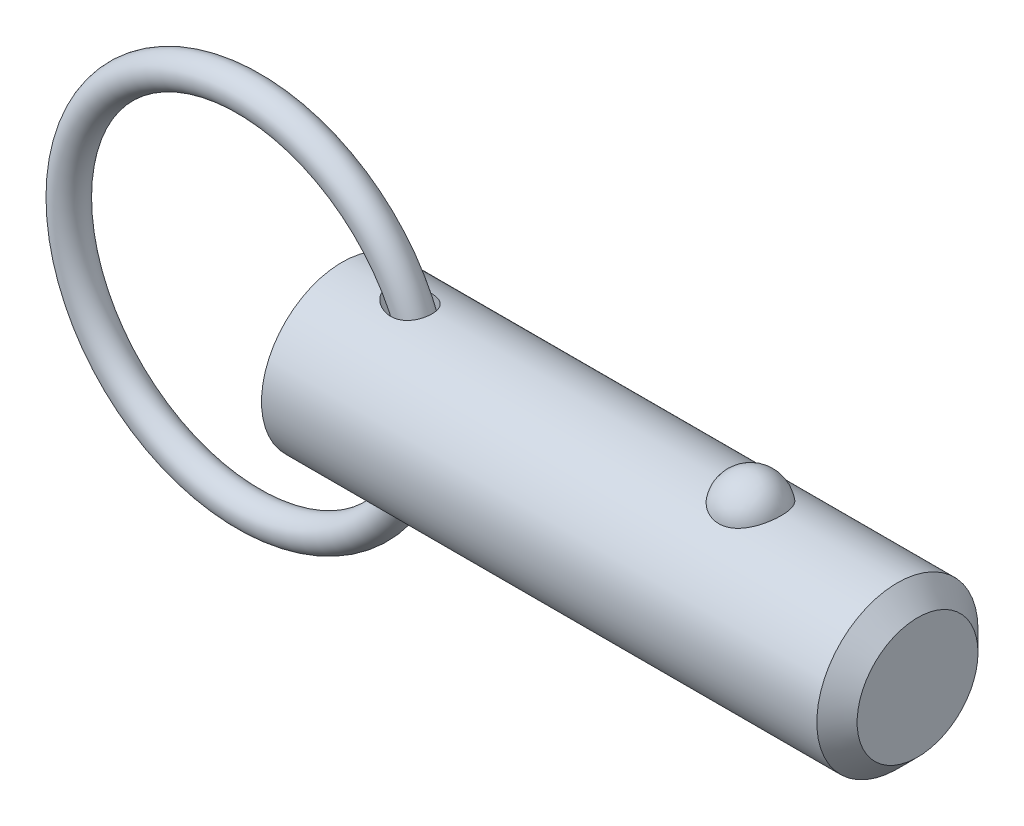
ISO-10303-21;
HEADER;
FILE_DESCRIPTION(('STEP AP214'),'2;1');
FILE_NAME('part.step','',(''),(''),'','','');
FILE_SCHEMA(('AUTOMOTIVE_DESIGN { 1 0 10303 214 1 1 1 1 }'));
ENDSEC;
DATA;
#1=APPLICATION_CONTEXT('core data for automotive mechanical design processes');
#2=APPLICATION_PROTOCOL_DEFINITION('international standard','automotive_design',2000,#1);
#3=PRODUCT_CONTEXT('',#1,'mechanical');
#4=PRODUCT('Part','Part','',(#3));
#5=PRODUCT_RELATED_PRODUCT_CATEGORY('part','',(#4));
#6=PRODUCT_DEFINITION_FORMATION('','',#4);
#7=PRODUCT_DEFINITION_CONTEXT('part definition',#1,'design');
#8=PRODUCT_DEFINITION('design','',#6,#7);
#9=PRODUCT_DEFINITION_SHAPE('','',#8);
#10=(LENGTH_UNIT() NAMED_UNIT(*) SI_UNIT(.MILLI.,.METRE.));
#11=(NAMED_UNIT(*) PLANE_ANGLE_UNIT() SI_UNIT($,.RADIAN.));
#12=(NAMED_UNIT(*) SI_UNIT($,.STERADIAN.) SOLID_ANGLE_UNIT());
#13=UNCERTAINTY_MEASURE_WITH_UNIT(LENGTH_MEASURE(1.E-05),#10,'distance_accuracy_value','');
#14=(GEOMETRIC_REPRESENTATION_CONTEXT(3) GLOBAL_UNCERTAINTY_ASSIGNED_CONTEXT((#13)) GLOBAL_UNIT_ASSIGNED_CONTEXT((#10,
#11,#12)) REPRESENTATION_CONTEXT('',''));
#15=CARTESIAN_POINT('',(0.,0.,0.));
#16=DIRECTION('',(0.,0.,1.));
#17=DIRECTION('',(1.,0.,0.));
#18=AXIS2_PLACEMENT_3D('',#15,#16,#17);
#19=CARTESIAN_POINT('',(-8.23730968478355,0.,0.));
#20=DIRECTION('',(0.,0.,1.));
#21=DIRECTION('',(1.,0.,0.));
#22=AXIS2_PLACEMENT_3D('',#19,#20,#21);
#23=TOROIDAL_SURFACE('',#22,15.875,1.422);
#24=CARTESIAN_POINT('',(9.05969031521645,0.,0.));
#25=VERTEX_POINT('',#24);
#26=VERTEX_LOOP('',#25);
#27=FACE_BOUND('',#26,.T.);
#28=ADVANCED_FACE('P0_F12',(#27),#23,.T.);
#29=CLOSED_SHELL('',(#28));
#30=MANIFOLD_SOLID_BREP('P0_B1',#29);
#31=CARTESIAN_POINT('',(0.,0.,0.));
#32=DIRECTION('',(1.,0.,0.));
#33=DIRECTION('',(0.,0.,-1.));
#34=AXIS2_PLACEMENT_3D('',#31,#32,#33);
#35=CYLINDRICAL_SURFACE('',#34,7.11);
#36=CARTESIAN_POINT('',(3.98467340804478,7.10072679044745,-0.363013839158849));
#37=CARTESIAN_POINT('',(4.00971652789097,7.09600153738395,-0.45539194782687));
#38=CARTESIAN_POINT('',(4.04401947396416,7.08958406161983,-0.545230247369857));
#39=CARTESIAN_POINT('',(4.12810160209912,7.07427055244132,-0.717157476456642));
#40=CARTESIAN_POINT('',(4.17791765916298,7.06536861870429,-0.799227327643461));
#41=CARTESIAN_POINT('',(4.28924471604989,7.04620300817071,-0.953469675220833));
#42=CARTESIAN_POINT('',(4.35063580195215,7.035953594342,-1.02573162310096));
#43=CARTESIAN_POINT('',(4.48282610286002,7.01493313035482,-1.16081412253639));
#44=CARTESIAN_POINT('',(4.55362244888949,7.00416223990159,-1.22363754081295));
#45=CARTESIAN_POINT('',(4.71659336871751,6.98090398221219,-1.35055080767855));
#46=CARTESIAN_POINT('',(4.81029272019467,6.96847103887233,-1.41269256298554));
#47=CARTESIAN_POINT('',(5.0057240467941,6.94515366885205,-1.52319699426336));
#48=CARTESIAN_POINT('',(5.10746392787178,6.93427079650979,-1.57154588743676));
#49=CARTESIAN_POINT('',(5.33503739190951,6.91346066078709,-1.66091325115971));
#50=CARTESIAN_POINT('',(5.46199550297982,6.90402388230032,-1.69921932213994));
#51=CARTESIAN_POINT('',(5.72084799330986,6.89024030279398,-1.75428261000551));
#52=CARTESIAN_POINT('',(5.85274301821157,6.88589416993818,-1.77103699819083));
#53=CARTESIAN_POINT('',(6.11557710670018,6.88337277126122,-1.78081990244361));
#54=CARTESIAN_POINT('',(6.24650031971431,6.88510489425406,-1.77420448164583));
#55=CARTESIAN_POINT('',(6.50446311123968,6.89478744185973,-1.73620392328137));
#56=CARTESIAN_POINT('',(6.6315075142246,6.90272978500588,-1.70485097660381));
#57=CARTESIAN_POINT('',(6.85933269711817,6.92243075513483,-1.62281888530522));
#58=CARTESIAN_POINT('',(6.96133251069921,6.93352131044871,-1.5753580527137));
#59=CARTESIAN_POINT('',(7.15436649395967,6.95824811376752,-1.46226310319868));
#60=CARTESIAN_POINT('',(7.24540699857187,6.97188287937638,-1.3966395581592));
#61=CARTESIAN_POINT('',(7.40446019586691,6.99838217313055,-1.25668991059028));
#62=CARTESIAN_POINT('',(7.473875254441,7.01118308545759,-1.18393777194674));
#63=CARTESIAN_POINT('',(7.59904891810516,7.03582803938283,-1.02736918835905));
#64=CARTESIAN_POINT('',(7.65481029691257,7.04767227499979,-0.943554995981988));
#65=CARTESIAN_POINT('',(7.74982438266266,7.06873077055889,-0.76979592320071));
#66=CARTESIAN_POINT('',(7.7894903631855,7.07800861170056,-0.680084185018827));
#67=CARTESIAN_POINT('',(7.85354088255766,7.09334756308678,-0.495102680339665));
#68=CARTESIAN_POINT('',(7.87792559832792,7.09940871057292,-0.399832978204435));
#69=CARTESIAN_POINT('',(7.9108898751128,7.10766731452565,-0.206294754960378));
#70=CARTESIAN_POINT('',(7.91944662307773,7.10985919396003,-0.108022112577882));
#71=CARTESIAN_POINT('',(7.920501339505,7.11012756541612,0.0886168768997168));
#72=CARTESIAN_POINT('',(7.91299895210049,7.10820396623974,0.186983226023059));
#73=CARTESIAN_POINT('',(7.88205794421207,7.10043733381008,0.381270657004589));
#74=CARTESIAN_POINT('',(7.85857985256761,7.09458459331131,0.477185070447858));
#75=CARTESIAN_POINT('',(7.79617406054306,7.07958431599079,0.663575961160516));
#76=CARTESIAN_POINT('',(7.75724672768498,7.07043685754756,0.754052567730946));
#77=CARTESIAN_POINT('',(7.66496731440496,7.04987259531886,0.926798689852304));
#78=CARTESIAN_POINT('',(7.61164530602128,7.0384605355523,1.00908483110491));
#79=CARTESIAN_POINT('',(7.49191707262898,7.01461776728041,1.16333092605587));
#80=CARTESIAN_POINT('',(7.42551210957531,7.00218715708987,1.235291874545));
#81=CARTESIAN_POINT('',(7.28164031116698,6.97770944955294,1.36680167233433));
#82=CARTESIAN_POINT('',(7.20420170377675,6.96566146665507,1.42638126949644));
#83=CARTESIAN_POINT('',(7.0403906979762,6.94319963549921,1.53199377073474));
#84=CARTESIAN_POINT('',(6.95401827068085,6.93278579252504,1.57802663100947));
#85=CARTESIAN_POINT('',(6.7731858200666,6.91444459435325,1.65656940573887));
#86=CARTESIAN_POINT('',(6.67860569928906,6.90656682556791,1.68881327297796));
#87=CARTESIAN_POINT('',(6.48544119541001,6.89422806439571,1.73849768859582));
#88=CARTESIAN_POINT('',(6.38685561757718,6.88976809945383,1.755933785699));
#89=CARTESIAN_POINT('',(6.18089829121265,6.88429907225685,1.77726234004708));
#90=CARTESIAN_POINT('',(6.07340937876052,6.88356485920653,1.78007646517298));
#91=CARTESIAN_POINT('',(5.85921220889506,6.886086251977,1.77029087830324));
#92=CARTESIAN_POINT('',(5.75250426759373,6.88934339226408,1.75768523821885));
#93=CARTESIAN_POINT('',(5.52848027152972,6.89994454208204,1.71563399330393));
#94=CARTESIAN_POINT('',(5.41155168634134,6.90775772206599,1.68424184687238));
#95=CARTESIAN_POINT('',(5.18376466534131,6.92670168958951,1.60454711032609));
#96=CARTESIAN_POINT('',(5.07291446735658,6.9378368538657,1.5562221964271));
#97=CARTESIAN_POINT('',(4.84835244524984,6.96347168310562,1.43744827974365));
#98=CARTESIAN_POINT('',(4.73562531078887,6.97820486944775,1.36517310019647));
#99=CARTESIAN_POINT('',(4.52504912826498,7.00822340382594,1.20158053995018));
#100=CARTESIAN_POINT('',(4.42717478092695,7.02350775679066,1.11029618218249));
#101=CARTESIAN_POINT('',(4.27935716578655,7.04784659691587,0.940654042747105));
#102=CARTESIAN_POINT('',(4.2239722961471,7.05736064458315,0.867099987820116));
#103=CARTESIAN_POINT('',(4.12558347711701,7.07469854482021,0.711919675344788));
#104=CARTESIAN_POINT('',(4.08256922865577,7.0825238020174,0.630300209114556));
#105=CARTESIAN_POINT('',(4.01142860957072,7.09565978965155,0.459428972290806));
#106=CARTESIAN_POINT('',(3.98346043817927,7.10094374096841,0.370107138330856));
#107=CARTESIAN_POINT('',(3.95517285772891,7.1063173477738,0.233358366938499));
#108=CARTESIAN_POINT('',(3.94802115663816,7.1076831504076,0.187321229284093));
#109=CARTESIAN_POINT('',(3.93842121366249,7.10951900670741,0.0947476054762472));
#110=CARTESIAN_POINT('',(3.93597129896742,7.10998937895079,0.0482113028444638));
#111=CARTESIAN_POINT('',(3.93584361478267,7.11001358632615,-0.0598597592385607));
#112=CARTESIAN_POINT('',(3.9399538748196,7.10922402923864,-0.121405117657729));
#113=CARTESIAN_POINT('',(3.95632793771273,7.10609781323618,-0.243320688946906));
#114=CARTESIAN_POINT('',(3.96859135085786,7.10376122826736,-0.303690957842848));
#115=CARTESIAN_POINT('',(3.98467340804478,7.10072679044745,-0.363013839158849));
#116=B_SPLINE_CURVE_WITH_KNOTS('',3,(#36,#37,#38,#39,#40,#41,#42,#43,#44,#45,#46,#47,#48,#49,
#50,#51,#52,#53,#54,#55,#56,#57,#58,#59,#60,#61,#62,#63,#64,#65,#66,#67,#68,#69,#70,#71,#72,#73,
#74,#75,#76,#77,#78,#79,#80,#81,#82,#83,#84,#85,#86,#87,#88,#89,#90,#91,#92,#93,#94,#95,#96,#97,
#98,#99,#100,#101,#102,#103,#104,#105,#106,#107,#108,#109,#110,#111,#112,#113,#114,#115),
.UNSPECIFIED.,.T.,.F.,(4,2,2,2,2,2,2,2,2,2,2,2,2,2,2,2,2,2,2,2,2,2,2,2,2,2,2,2,2,2,2,2,2,2,2,2,
2,2,2,4),(0.,0.287206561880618,0.575101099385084,0.860162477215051,1.14513709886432,
1.48324846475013,1.82169652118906,2.21865672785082,2.6156690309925,3.00665870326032,
3.39714041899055,3.73437585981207,4.07141541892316,4.37402271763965,4.67656849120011,
4.97076150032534,5.26495110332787,5.55956439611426,5.85418421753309,6.14953461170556,
6.44487798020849,6.73960905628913,7.03431171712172,7.32827352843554,7.6222362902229,
7.9216396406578,8.22113296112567,8.54242840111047,8.86384740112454,9.22635035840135,
9.58933304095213,9.99153142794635,10.3930368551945,10.6697219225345,10.9461759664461,
11.2254825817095,11.3650959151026,11.5046595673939,11.6891051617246,11.8735419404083),.UNSPECIFIED.);
#117=CARTESIAN_POINT('',(3.98467340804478,7.10072679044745,-0.363013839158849));
#118=VERTEX_POINT('',#117);
#119=EDGE_CURVE('P1_E40',#118,#118,#116,.T.);
#120=ORIENTED_EDGE('',*,*,#119,.T.);
#121=EDGE_LOOP('',(#120));
#122=FACE_BOUND('',#121,.T.);
#123=CARTESIAN_POINT('',(48.9925,0.,0.));
#124=DIRECTION('',(1.,0.,0.));
#125=DIRECTION('',(0.,0.,-1.));
#126=AXIS2_PLACEMENT_3D('',#123,#124,#125);
#127=CIRCLE('',#126,7.11);
#128=CARTESIAN_POINT('',(48.9925,0.,-7.11));
#129=VERTEX_POINT('',#128);
#130=EDGE_CURVE('P1_E25',#129,#129,#127,.T.);
#131=ORIENTED_EDGE('',*,*,#130,.F.);
#132=EDGE_LOOP('',(#131));
#133=FACE_BOUND('',#132,.T.);
#134=CARTESIAN_POINT('',(0.,0.,0.));
#135=DIRECTION('',(1.,0.,0.));
#136=DIRECTION('',(0.,0.,-1.));
#137=AXIS2_PLACEMENT_3D('',#134,#135,#136);
#138=CIRCLE('',#137,7.11);
#139=CARTESIAN_POINT('',(0.,0.,-7.11));
#140=VERTEX_POINT('',#139);
#141=EDGE_CURVE('P1_E9',#140,#140,#138,.T.);
#142=ORIENTED_EDGE('',*,*,#141,.T.);
#143=EDGE_LOOP('',(#142));
#144=FACE_BOUND('',#143,.T.);
#145=CARTESIAN_POINT('',(36.029258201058,6.5364666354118,2.79762469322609));
#146=CARTESIAN_POINT('',(35.8844296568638,6.53647876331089,2.79761243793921));
#147=CARTESIAN_POINT('',(35.7393684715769,6.54144531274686,2.78608115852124));
#148=CARTESIAN_POINT('',(35.4532920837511,6.56077791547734,2.7402328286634));
#149=CARTESIAN_POINT('',(35.3122884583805,6.5751685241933,2.7058562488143));
#150=CARTESIAN_POINT('',(35.0388833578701,6.61165072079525,2.61544042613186));
#151=CARTESIAN_POINT('',(34.9064602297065,6.63372195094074,2.55945840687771));
#152=CARTESIAN_POINT('',(34.6532337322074,6.68316012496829,2.42742958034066));
#153=CARTESIAN_POINT('',(34.5324254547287,6.71052481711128,2.35139129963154));
#154=CARTESIAN_POINT('',(34.3016372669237,6.76860821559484,2.17866150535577));
#155=CARTESIAN_POINT('',(34.1920857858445,6.79940242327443,2.08142342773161));
#156=CARTESIAN_POINT('',(33.9903340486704,6.86050242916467,1.87020907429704));
#157=CARTESIAN_POINT('',(33.8981390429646,6.89080807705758,1.75622775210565));
#158=CARTESIAN_POINT('',(33.7292547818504,6.94923069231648,1.50900646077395));
#159=CARTESIAN_POINT('',(33.6534289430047,6.97719213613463,1.37513873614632));
#160=CARTESIAN_POINT('',(33.5242063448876,7.02647251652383,1.09584817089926));
#161=CARTESIAN_POINT('',(33.4708109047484,7.04779106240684,0.950424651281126));
#162=CARTESIAN_POINT('',(33.3871019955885,7.08180248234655,0.650508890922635));
#163=CARTESIAN_POINT('',(33.3570253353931,7.09440672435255,0.49594033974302));
#164=CARTESIAN_POINT('',(33.3214735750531,7.10935121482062,0.183515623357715));
#165=CARTESIAN_POINT('',(33.3159974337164,7.11169189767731,0.0256595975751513));
#166=CARTESIAN_POINT('',(33.329700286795,7.10589702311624,-0.287512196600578));
#167=CARTESIAN_POINT('',(33.3486823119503,7.0978451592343,-0.442838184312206));
#168=CARTESIAN_POINT('',(33.4105745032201,7.07221860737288,-0.747830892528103));
#169=CARTESIAN_POINT('',(33.4534850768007,7.05464375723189,-0.897497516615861));
#170=CARTESIAN_POINT('',(33.5624527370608,7.01171031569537,-1.18722864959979));
#171=CARTESIAN_POINT('',(33.6285458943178,6.98633960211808,-1.32727778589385));
#172=CARTESIAN_POINT('',(33.7825362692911,6.93042258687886,-1.59370324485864));
#173=CARTESIAN_POINT('',(33.8704355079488,6.89987580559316,-1.7200782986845));
#174=CARTESIAN_POINT('',(34.0669269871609,6.83659510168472,-1.95657345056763));
#175=CARTESIAN_POINT('',(34.1756640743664,6.80384697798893,-2.06656957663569));
#176=CARTESIAN_POINT('',(34.4109686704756,6.7400183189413,-2.26611005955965));
#177=CARTESIAN_POINT('',(34.5375350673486,6.70893767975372,-2.35565569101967));
#178=CARTESIAN_POINT('',(34.8028454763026,6.65264442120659,-2.51019726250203));
#179=CARTESIAN_POINT('',(34.9413230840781,6.62733449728,-2.57561395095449));
#180=CARTESIAN_POINT('',(35.2285194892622,6.58495995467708,-2.68211134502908));
#181=CARTESIAN_POINT('',(35.3772343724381,6.56789220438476,-2.7232012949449));
#182=CARTESIAN_POINT('',(35.6726268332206,6.54478663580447,-2.77825810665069));
#183=CARTESIAN_POINT('',(35.8190295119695,6.53823639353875,-2.79348727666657));
#184=CARTESIAN_POINT('',(36.1124700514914,6.53532718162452,-2.80028921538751));
#185=CARTESIAN_POINT('',(36.2595077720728,6.53896606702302,-2.79186696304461));
#186=CARTESIAN_POINT('',(36.5449210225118,6.55570357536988,-2.75232178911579));
#187=CARTESIAN_POINT('',(36.6834221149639,6.56848455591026,-2.72196077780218));
#188=CARTESIAN_POINT('',(36.9531142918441,6.60173528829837,-2.64028774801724));
#189=CARTESIAN_POINT('',(37.084304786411,6.62220565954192,-2.58897404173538));
#190=CARTESIAN_POINT('',(37.3388462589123,6.66917927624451,-2.4654782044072));
#191=CARTESIAN_POINT('',(37.4619691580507,6.69580233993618,-2.39287266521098));
#192=CARTESIAN_POINT('',(37.6944418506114,6.75207041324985,-2.2291526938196));
#193=CARTESIAN_POINT('',(37.8037884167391,6.78171612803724,-2.13803393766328));
#194=CARTESIAN_POINT('',(38.011642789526,6.84264629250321,-1.93445592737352));
#195=CARTESIAN_POINT('',(38.1093178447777,6.87393748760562,-1.82114774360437));
#196=CARTESIAN_POINT('',(38.2850112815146,6.93345710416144,-1.57947787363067));
#197=CARTESIAN_POINT('',(38.3630261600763,6.96168497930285,-1.4511135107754));
#198=CARTESIAN_POINT('',(38.4999857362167,7.01307558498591,-1.17842708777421));
#199=CARTESIAN_POINT('',(38.5582588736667,7.03605262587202,-1.03373189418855));
#200=CARTESIAN_POINT('',(38.6510815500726,7.07340932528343,-0.735867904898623));
#201=CARTESIAN_POINT('',(38.6856311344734,7.08778900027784,-0.582699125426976));
#202=CARTESIAN_POINT('',(38.7302742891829,7.10647639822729,-0.272420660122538));
#203=CARTESIAN_POINT('',(38.74039710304,7.11079616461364,-0.115315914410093));
#204=CARTESIAN_POINT('',(38.736061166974,7.10896059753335,0.198488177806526));
#205=CARTESIAN_POINT('',(38.7216031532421,7.10280557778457,0.355187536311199));
#206=CARTESIAN_POINT('',(38.6685727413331,7.08071500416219,0.662724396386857));
#207=CARTESIAN_POINT('',(38.6301505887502,7.06484039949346,0.813592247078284));
#208=CARTESIAN_POINT('',(38.530101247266,7.0249589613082,1.10629159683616));
#209=CARTESIAN_POINT('',(38.4684724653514,7.00095156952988,1.24812247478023));
#210=CARTESIAN_POINT('',(38.3227668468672,6.94706632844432,1.51976439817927));
#211=CARTESIAN_POINT('',(38.2385448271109,6.91715085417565,1.64949012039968));
#212=CARTESIAN_POINT('',(38.0495861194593,6.8547056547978,1.89231285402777));
#213=CARTESIAN_POINT('',(37.9448501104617,6.82217601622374,2.00541041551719));
#214=CARTESIAN_POINT('',(37.7171030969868,6.75805358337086,2.21190674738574));
#215=CARTESIAN_POINT('',(37.594082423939,6.72646129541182,2.30529503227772));
#216=CARTESIAN_POINT('',(37.3327347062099,6.66789520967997,2.46959908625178));
#217=CARTESIAN_POINT('',(37.1944019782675,6.64092313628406,2.54050647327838));
#218=CARTESIAN_POINT('',(36.9111828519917,6.5957258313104,2.65560045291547));
#219=CARTESIAN_POINT('',(36.7666660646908,6.57724013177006,2.70059539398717));
#220=CARTESIAN_POINT('',(36.4715469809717,6.55006426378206,2.76587321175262));
#221=CARTESIAN_POINT('',(36.3209640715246,6.54134511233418,2.78622922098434));
#222=CARTESIAN_POINT('',(36.1230463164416,6.53697847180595,2.7964243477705));
#223=CARTESIAN_POINT('',(36.0761644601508,6.53646270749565,2.79762866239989));
#224=CARTESIAN_POINT('',(36.029258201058,6.5364666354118,2.79762469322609));
#225=B_SPLINE_CURVE_WITH_KNOTS('',3,(#145,#146,#147,#148,#149,#150,#151,#152,#153,#154,#155,
#156,#157,#158,#159,#160,#161,#162,#163,#164,#165,#166,#167,#168,#169,#170,#171,#172,#173,#174,
#175,#176,#177,#178,#179,#180,#181,#182,#183,#184,#185,#186,#187,#188,#189,#190,#191,#192,#193,
#194,#195,#196,#197,#198,#199,#200,#201,#202,#203,#204,#205,#206,#207,#208,#209,#210,#211,#212,
#213,#214,#215,#216,#217,#218,#219,#220,#221,#222,#223,#224),.UNSPECIFIED.,.T.,.F.,(4,2,2,2,2,2,
2,2,2,2,2,2,2,2,2,2,2,2,2,2,2,2,2,2,2,2,2,2,2,2,2,2,2,2,2,2,2,2,2,4),(0.,0.434355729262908,
0.869847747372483,1.30419416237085,1.73835621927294,2.18541922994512,2.63261726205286,
3.09954261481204,3.56649542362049,4.03813031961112,4.50974525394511,4.97758575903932,
5.44543423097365,5.9140138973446,6.38263700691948,6.8546441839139,7.32662193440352,
7.78992971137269,8.25306131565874,8.69285754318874,9.13256119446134,9.5576862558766,
9.9828455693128,10.4171106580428,10.8514772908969,11.3079089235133,11.7644218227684,
12.2351898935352,12.7059570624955,13.1761603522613,13.6463495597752,14.1136200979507,
14.580922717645,15.0513032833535,15.5216682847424,15.9922828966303,16.4630727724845,
16.9182457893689,17.3720644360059,17.5127411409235),.UNSPECIFIED.);
#226=CARTESIAN_POINT('',(36.029258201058,6.5364666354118,2.79762469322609));
#227=VERTEX_POINT('',#226);
#228=EDGE_CURVE('P1_E34',#227,#227,#225,.T.);
#229=ORIENTED_EDGE('',*,*,#228,.T.);
#230=EDGE_LOOP('',(#229));
#231=FACE_BOUND('',#230,.T.);
#232=CARTESIAN_POINT('',(3.98467340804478,-7.10072679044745,-0.363013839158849));
#233=CARTESIAN_POINT('',(3.96426456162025,-7.10457733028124,-0.287714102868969));
#234=CARTESIAN_POINT('',(3.95000501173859,-7.10730349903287,-0.210695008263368));
#235=CARTESIAN_POINT('',(3.93481801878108,-7.11020840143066,-0.0553038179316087));
#236=CARTESIAN_POINT('',(3.93388435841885,-7.11038832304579,0.0230676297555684));
#237=CARTESIAN_POINT('',(3.94541910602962,-7.10817995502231,0.178714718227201));
#238=CARTESIAN_POINT('',(3.95787987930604,-7.10579312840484,0.25599095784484));
#239=CARTESIAN_POINT('',(3.99523775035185,-7.09872642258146,0.407352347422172));
#240=CARTESIAN_POINT('',(4.02014065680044,-7.09404547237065,0.481435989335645));
#241=CARTESIAN_POINT('',(4.08119600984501,-7.08278363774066,0.625775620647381));
#242=CARTESIAN_POINT('',(4.11749458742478,-7.07617815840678,0.695967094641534));
#243=CARTESIAN_POINT('',(4.19940836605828,-7.06165305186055,0.830508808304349));
#244=CARTESIAN_POINT('',(4.24502952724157,-7.0537325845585,0.894855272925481));
#245=CARTESIAN_POINT('',(4.36790232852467,-7.03310314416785,1.04688574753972));
#246=CARTESIAN_POINT('',(4.44977459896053,-7.01993229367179,1.13078695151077));
#247=CARTESIAN_POINT('',(4.62610796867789,-6.99351259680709,1.28411726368));
#248=CARTESIAN_POINT('',(4.7205898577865,-6.98026365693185,1.35352197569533));
#249=CARTESIAN_POINT('',(4.92036507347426,-6.9549104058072,1.47831921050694));
#250=CARTESIAN_POINT('',(5.02579054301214,-6.94282458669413,1.53350332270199));
#251=CARTESIAN_POINT('',(5.24378330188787,-6.92129098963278,1.62793610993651));
#252=CARTESIAN_POINT('',(5.35635066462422,-6.91184323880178,1.66718462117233));
#253=CARTESIAN_POINT('',(5.60134354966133,-6.89573491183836,1.73269893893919));
#254=CARTESIAN_POINT('',(5.73444697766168,-6.8895970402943,1.75661057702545));
#255=CARTESIAN_POINT('',(6.00300738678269,-6.88344616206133,1.78057487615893));
#256=CARTESIAN_POINT('',(6.13846360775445,-6.88343121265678,1.78063510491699));
#257=CARTESIAN_POINT('',(6.39660470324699,-6.88981379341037,1.75576480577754));
#258=CARTESIAN_POINT('',(6.51947843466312,-6.89572457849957,1.73273121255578));
#259=CARTESIAN_POINT('',(6.75813770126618,-6.91274434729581,1.66352936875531));
#260=CARTESIAN_POINT('',(6.87393155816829,-6.92384709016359,1.61738888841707));
#261=CARTESIAN_POINT('',(7.07801861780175,-6.94787316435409,1.51052664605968));
#262=CARTESIAN_POINT('',(7.16789841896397,-6.96033024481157,1.45271574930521));
#263=CARTESIAN_POINT('',(7.33546773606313,-6.98638661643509,1.32171912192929));
#264=CARTESIAN_POINT('',(7.41316182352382,-6.99998547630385,1.24853918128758));
#265=CARTESIAN_POINT('',(7.54861420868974,-7.02559503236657,1.09486170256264));
#266=CARTESIAN_POINT('',(7.60741145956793,-7.03764930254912,1.01528346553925));
#267=CARTESIAN_POINT('',(7.71070740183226,-7.0598657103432,0.847099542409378));
#268=CARTESIAN_POINT('',(7.75520788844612,-7.0700280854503,0.758494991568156));
#269=CARTESIAN_POINT('',(7.82836147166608,-7.08722075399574,0.575936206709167));
#270=CARTESIAN_POINT('',(7.85719783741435,-7.09428707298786,0.482058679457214));
#271=CARTESIAN_POINT('',(7.89918378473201,-7.10470260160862,0.29065874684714));
#272=CARTESIAN_POINT('',(7.91233308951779,-7.10805174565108,0.193136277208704));
#273=CARTESIAN_POINT('',(7.92267451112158,-7.11067890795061,-0.00313968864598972));
#274=CARTESIAN_POINT('',(7.91981203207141,-7.10994299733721,-0.10189624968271));
#275=CARTESIAN_POINT('',(7.89806489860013,-7.10444651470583,-0.297516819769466));
#276=CARTESIAN_POINT('',(7.87918005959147,-7.09968589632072,-0.394380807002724));
#277=CARTESIAN_POINT('',(7.82577988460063,-7.0866471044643,-0.58355375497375));
#278=CARTESIAN_POINT('',(7.79124976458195,-7.07836560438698,-0.675858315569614));
#279=CARTESIAN_POINT('',(7.70736343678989,-7.05919003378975,-0.853167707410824));
#280=CARTESIAN_POINT('',(7.65800801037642,-7.04829610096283,-0.938172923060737));
#281=CARTESIAN_POINT('',(7.54590141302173,-7.02513961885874,-1.09819812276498));
#282=CARTESIAN_POINT('',(7.48319521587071,-7.01288172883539,-1.17325029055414));
#283=CARTESIAN_POINT('',(7.34599775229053,-6.98832192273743,-1.31164333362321));
#284=CARTESIAN_POINT('',(7.27150757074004,-6.97602001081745,-1.37498528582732));
#285=CARTESIAN_POINT('',(7.11277776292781,-6.95268608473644,-1.48849974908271));
#286=CARTESIAN_POINT('',(7.02852525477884,-6.94165578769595,-1.53865456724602));
#287=CARTESIAN_POINT('',(6.85282430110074,-6.92200320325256,-1.62478650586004));
#288=CARTESIAN_POINT('',(6.76137511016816,-6.91338116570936,-1.66076215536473));
#289=CARTESIAN_POINT('',(6.57061179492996,-6.89906044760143,-1.71930563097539));
#290=CARTESIAN_POINT('',(6.47113516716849,-6.89347290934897,-1.74136795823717));
#291=CARTESIAN_POINT('',(6.26989833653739,-6.88605020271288,-1.7704895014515));
#292=CARTESIAN_POINT('',(6.16813737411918,-6.88421630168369,-1.77754365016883));
#293=CARTESIAN_POINT('',(5.95492537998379,-6.88424071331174,-1.77745174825));
#294=CARTESIAN_POINT('',(5.8434768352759,-6.88646827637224,-1.76888555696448));
#295=CARTESIAN_POINT('',(5.62307560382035,-6.89483827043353,-1.73596677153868));
#296=CARTESIAN_POINT('',(5.51412477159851,-6.90098351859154,-1.71160281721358));
#297=CARTESIAN_POINT('',(5.28644478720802,-6.91743803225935,-1.64393691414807));
#298=CARTESIAN_POINT('',(5.16837217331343,-6.92819628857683,-1.59852806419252));
#299=CARTESIAN_POINT('',(4.94091825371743,-6.95234836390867,-1.4899796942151));
#300=CARTESIAN_POINT('',(4.83153887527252,-6.96574276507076,-1.42683625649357));
#301=CARTESIAN_POINT('',(4.63576710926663,-6.99209234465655,-1.29112257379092));
#302=CARTESIAN_POINT('',(4.54816728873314,-7.00494184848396,-1.22027748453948));
#303=CARTESIAN_POINT('',(4.38554897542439,-7.03019055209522,-1.0652111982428));
#304=CARTESIAN_POINT('',(4.31052141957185,-7.04259007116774,-0.980999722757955));
#305=CARTESIAN_POINT('',(4.18551811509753,-7.0640229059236,-0.811206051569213));
#306=CARTESIAN_POINT('',(4.13358417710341,-7.07328321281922,-0.727107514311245));
#307=CARTESIAN_POINT('',(4.04607461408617,-7.0891994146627,-0.550580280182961));
#308=CARTESIAN_POINT('',(4.01046401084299,-7.09586087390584,-0.458169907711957));
#309=CARTESIAN_POINT('',(3.98467340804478,-7.10072679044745,-0.363013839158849));
#310=B_SPLINE_CURVE_WITH_KNOTS('',3,(#232,#233,#234,#235,#236,#237,#238,#239,#240,#241,#242,
#243,#244,#245,#246,#247,#248,#249,#250,#251,#252,#253,#254,#255,#256,#257,#258,#259,#260,#261,
#262,#263,#264,#265,#266,#267,#268,#269,#270,#271,#272,#273,#274,#275,#276,#277,#278,#279,#280,
#281,#282,#283,#284,#285,#286,#287,#288,#289,#290,#291,#292,#293,#294,#295,#296,#297,#298,#299,
#300,#301,#302,#303,#304,#305,#306,#307,#308,#309),.UNSPECIFIED.,.T.,.F.,(4,2,2,2,2,2,2,2,2,2,2,
2,2,2,2,2,2,2,2,2,2,2,2,2,2,2,2,2,2,2,2,2,2,2,2,2,2,2,4),(0.,0.23402065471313,0.467932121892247,
0.701710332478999,0.935597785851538,1.17261620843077,1.40978663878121,1.76177576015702,
2.11435255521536,2.47183528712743,2.8293216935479,3.23332937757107,3.63720887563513,
4.01042610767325,4.38319587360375,4.70425151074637,5.02518641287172,5.32277979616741,
5.62033579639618,5.91433101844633,6.2083314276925,6.50333490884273,6.79834178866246,
7.09362801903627,7.38889868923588,7.6831900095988,7.9774542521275,8.27211131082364,
8.56679892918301,8.8716552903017,9.17661456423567,9.51069129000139,9.84500851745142,
10.2243046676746,10.6036846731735,10.9425776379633,11.2812252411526,11.5775945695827,
11.8733258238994),.UNSPECIFIED.);
#311=CARTESIAN_POINT('',(3.98467340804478,-7.10072679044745,-0.363013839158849));
#312=VERTEX_POINT('',#311);
#313=EDGE_CURVE('P1_E17',#312,#312,#310,.T.);
#314=ORIENTED_EDGE('',*,*,#313,.T.);
#315=EDGE_LOOP('',(#314));
#316=FACE_BOUND('',#315,.T.);
#317=ADVANCED_FACE('P1_F13',(#122,#133,#144,#231,#316),#35,.T.);
#318=CARTESIAN_POINT('',(0.,0.,0.));
#319=DIRECTION('',(-1.,0.,0.));
#320=DIRECTION('',(0.,0.,1.));
#321=AXIS2_PLACEMENT_3D('',#318,#319,#320);
#322=PLANE('',#321);
#323=ORIENTED_EDGE('',*,*,#141,.F.);
#324=EDGE_LOOP('',(#323));
#325=FACE_BOUND('',#324,.T.);
#326=ADVANCED_FACE('P1_F15',(#325),#322,.T.);
#327=CARTESIAN_POINT('',(50.77,0.,0.));
#328=DIRECTION('',(-1.,0.,0.));
#329=DIRECTION('',(0.,0.,1.));
#330=AXIS2_PLACEMENT_3D('',#327,#328,#329);
#331=CONICAL_SURFACE('',#330,5.33250000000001,0.785398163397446);
#332=ORIENTED_EDGE('',*,*,#130,.T.);
#333=EDGE_LOOP('',(#332));
#334=FACE_BOUND('',#333,.T.);
#335=CARTESIAN_POINT('',(50.77,0.,0.));
#336=DIRECTION('',(1.,0.,0.));
#337=DIRECTION('',(0.,0.,-1.));
#338=AXIS2_PLACEMENT_3D('',#335,#336,#337);
#339=CIRCLE('',#338,5.33250000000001);
#340=CARTESIAN_POINT('',(50.77,0.,-5.33250000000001));
#341=VERTEX_POINT('',#340);
#342=EDGE_CURVE('P1_E30',#341,#341,#339,.T.);
#343=ORIENTED_EDGE('',*,*,#342,.F.);
#344=EDGE_LOOP('',(#343));
#345=FACE_BOUND('',#344,.T.);
#346=ADVANCED_FACE('P1_F55',(#334,#345),#331,.T.);
#347=CARTESIAN_POINT('',(50.77,5.33250000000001,0.));
#348=DIRECTION('',(1.,0.,0.));
#349=DIRECTION('',(0.,0.,-1.));
#350=AXIS2_PLACEMENT_3D('',#347,#348,#349);
#351=PLANE('',#350);
#352=ORIENTED_EDGE('',*,*,#342,.T.);
#353=EDGE_LOOP('',(#352));
#354=FACE_BOUND('',#353,.T.);
#355=ADVANCED_FACE('P1_F51',(#354),#351,.T.);
#356=CARTESIAN_POINT('',(36.029258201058,6.399,0.));
#357=DIRECTION('',(-1.,0.,0.));
#358=DIRECTION('',(0.,1.,0.));
#359=AXIS2_PLACEMENT_3D('',#356,#357,#358);
#360=SPHERICAL_SURFACE('',#359,2.80099999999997);
#361=ORIENTED_EDGE('',*,*,#228,.F.);
#362=EDGE_LOOP('',(#361));
#363=FACE_BOUND('',#362,.T.);
#364=ADVANCED_FACE('P1_F46',(#363),#360,.T.);
#365=CARTESIAN_POINT('',(-8.23730968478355,0.,0.));
#366=DIRECTION('',(0.,0.,1.));
#367=DIRECTION('',(1.,0.,0.));
#368=AXIS2_PLACEMENT_3D('',#365,#366,#367);
#369=TOROIDAL_SURFACE('',#368,15.875,1.7775);
#370=ORIENTED_EDGE('',*,*,#313,.F.);
#371=EDGE_LOOP('',(#370));
#372=FACE_BOUND('',#371,.T.);
#373=ORIENTED_EDGE('',*,*,#119,.F.);
#374=EDGE_LOOP('',(#373));
#375=FACE_BOUND('',#374,.T.);
#376=ADVANCED_FACE('P1_F50',(#372,#375),#369,.F.);
#377=CLOSED_SHELL('',(#317,#326,#346,#355,#364,#376));
#378=MANIFOLD_SOLID_BREP('P1_B1',#377);
#379=ADVANCED_BREP_SHAPE_REPRESENTATION('',(#18,#30,#378),#14);
#380=SHAPE_DEFINITION_REPRESENTATION(#9,#379);
ENDSEC;
END-ISO-10303-21;
